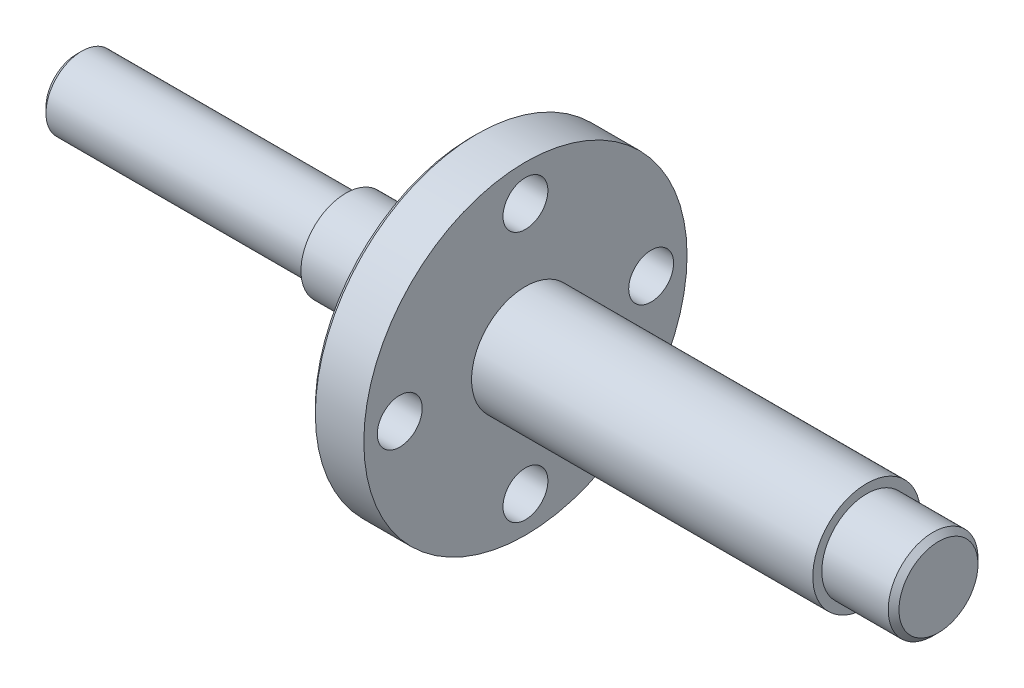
ISO-10303-21;
HEADER;
FILE_DESCRIPTION(('STEP AP214'),'2;1');
FILE_NAME('part.step','',(''),(''),'','','');
FILE_SCHEMA(('AUTOMOTIVE_DESIGN { 1 0 10303 214 1 1 1 1 }'));
ENDSEC;
DATA;
#1=APPLICATION_CONTEXT('core data for automotive mechanical design processes');
#2=APPLICATION_PROTOCOL_DEFINITION('international standard','automotive_design',2000,#1);
#3=PRODUCT_CONTEXT('',#1,'mechanical');
#4=PRODUCT('Part','Part','',(#3));
#5=PRODUCT_RELATED_PRODUCT_CATEGORY('part','',(#4));
#6=PRODUCT_DEFINITION_FORMATION('','',#4);
#7=PRODUCT_DEFINITION_CONTEXT('part definition',#1,'design');
#8=PRODUCT_DEFINITION('design','',#6,#7);
#9=PRODUCT_DEFINITION_SHAPE('','',#8);
#10=(LENGTH_UNIT() NAMED_UNIT(*) SI_UNIT(.MILLI.,.METRE.));
#11=(NAMED_UNIT(*) PLANE_ANGLE_UNIT() SI_UNIT($,.RADIAN.));
#12=(NAMED_UNIT(*) SI_UNIT($,.STERADIAN.) SOLID_ANGLE_UNIT());
#13=UNCERTAINTY_MEASURE_WITH_UNIT(LENGTH_MEASURE(1.E-05),#10,'distance_accuracy_value','');
#14=(GEOMETRIC_REPRESENTATION_CONTEXT(3) GLOBAL_UNCERTAINTY_ASSIGNED_CONTEXT((#13)) GLOBAL_UNIT_ASSIGNED_CONTEXT((#10,
#11,#12)) REPRESENTATION_CONTEXT('',''));
#15=CARTESIAN_POINT('',(0.,0.,0.));
#16=DIRECTION('',(0.,0.,1.));
#17=DIRECTION('',(1.,0.,0.));
#18=AXIS2_PLACEMENT_3D('',#15,#16,#17);
#19=CARTESIAN_POINT('',(44.,0.,0.));
#20=DIRECTION('',(1.,0.,0.));
#21=DIRECTION('',(0.,0.,-1.));
#22=AXIS2_PLACEMENT_3D('',#19,#20,#21);
#23=PLANE('',#22);
#24=CARTESIAN_POINT('',(44.,0.,0.));
#25=DIRECTION('',(1.,0.,0.));
#26=DIRECTION('',(0.,0.,-1.));
#27=AXIS2_PLACEMENT_3D('',#24,#25,#26);
#28=CIRCLE('',#27,3.);
#29=CARTESIAN_POINT('',(44.,0.,-3.));
#30=VERTEX_POINT('',#29);
#31=EDGE_CURVE('E96',#30,#30,#28,.T.);
#32=ORIENTED_EDGE('',*,*,#31,.T.);
#33=EDGE_LOOP('',(#32));
#34=FACE_BOUND('',#33,.T.);
#35=CARTESIAN_POINT('',(44.,0.,0.));
#36=DIRECTION('',(1.,0.,0.));
#37=DIRECTION('',(0.,0.,-1.));
#38=AXIS2_PLACEMENT_3D('',#35,#36,#37);
#39=CIRCLE('',#38,2.5);
#40=CARTESIAN_POINT('',(44.,0.,-2.5));
#41=VERTEX_POINT('',#40);
#42=EDGE_CURVE('E101',#41,#41,#39,.T.);
#43=ORIENTED_EDGE('',*,*,#42,.F.);
#44=EDGE_LOOP('',(#43));
#45=FACE_BOUND('',#44,.T.);
#46=ADVANCED_FACE('F38',(#34,#45),#23,.T.);
#47=CARTESIAN_POINT('',(25.,0.,0.));
#48=DIRECTION('',(1.,0.,0.));
#49=DIRECTION('',(0.,0.,-1.));
#50=AXIS2_PLACEMENT_3D('',#47,#48,#49);
#51=PLANE('',#50);
#52=CARTESIAN_POINT('',(25.,0.,-7.));
#53=DIRECTION('',(1.,0.,0.));
#54=DIRECTION('',(0.,0.,-1.));
#55=AXIS2_PLACEMENT_3D('',#52,#53,#54);
#56=CIRCLE('',#55,1.24999999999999);
#57=CARTESIAN_POINT('',(25.,0.,-8.24999999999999));
#58=VERTEX_POINT('',#57);
#59=EDGE_CURVE('E131',#58,#58,#56,.T.);
#60=ORIENTED_EDGE('',*,*,#59,.F.);
#61=EDGE_LOOP('',(#60));
#62=FACE_BOUND('',#61,.T.);
#63=CARTESIAN_POINT('',(25.,-7.,0.));
#64=DIRECTION('',(1.,0.,0.));
#65=DIRECTION('',(0.,0.,-1.));
#66=AXIS2_PLACEMENT_3D('',#63,#64,#65);
#67=CIRCLE('',#66,1.24999999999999);
#68=CARTESIAN_POINT('',(25.,-7.,-1.24999999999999));
#69=VERTEX_POINT('',#68);
#70=EDGE_CURVE('E123',#69,#69,#67,.T.);
#71=ORIENTED_EDGE('',*,*,#70,.F.);
#72=EDGE_LOOP('',(#71));
#73=FACE_BOUND('',#72,.T.);
#74=CARTESIAN_POINT('',(25.,0.,7.));
#75=DIRECTION('',(1.,0.,0.));
#76=DIRECTION('',(0.,0.,-1.));
#77=AXIS2_PLACEMENT_3D('',#74,#75,#76);
#78=CIRCLE('',#77,1.24999999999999);
#79=CARTESIAN_POINT('',(25.,0.,5.75000000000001));
#80=VERTEX_POINT('',#79);
#81=EDGE_CURVE('E115',#80,#80,#78,.T.);
#82=ORIENTED_EDGE('',*,*,#81,.F.);
#83=EDGE_LOOP('',(#82));
#84=FACE_BOUND('',#83,.T.);
#85=CARTESIAN_POINT('',(25.,7.,0.));
#86=DIRECTION('',(1.,0.,0.));
#87=DIRECTION('',(0.,0.,-1.));
#88=AXIS2_PLACEMENT_3D('',#85,#86,#87);
#89=CIRCLE('',#88,1.24999999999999);
#90=CARTESIAN_POINT('',(25.,7.,-1.24999999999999));
#91=VERTEX_POINT('',#90);
#92=EDGE_CURVE('E108',#91,#91,#89,.T.);
#93=ORIENTED_EDGE('',*,*,#92,.F.);
#94=EDGE_LOOP('',(#93));
#95=FACE_BOUND('',#94,.T.);
#96=CARTESIAN_POINT('',(25.,0.,0.));
#97=DIRECTION('',(1.,0.,0.));
#98=DIRECTION('',(0.,0.,-1.));
#99=AXIS2_PLACEMENT_3D('',#96,#97,#98);
#100=CIRCLE('',#99,9.);
#101=CARTESIAN_POINT('',(25.,0.,-9.));
#102=VERTEX_POINT('',#101);
#103=EDGE_CURVE('E89',#102,#102,#100,.T.);
#104=ORIENTED_EDGE('',*,*,#103,.T.);
#105=EDGE_LOOP('',(#104));
#106=FACE_BOUND('',#105,.T.);
#107=CARTESIAN_POINT('',(25.,0.,0.));
#108=DIRECTION('',(1.,0.,0.));
#109=DIRECTION('',(0.,0.,-1.));
#110=AXIS2_PLACEMENT_3D('',#107,#108,#109);
#111=CIRCLE('',#110,3.);
#112=CARTESIAN_POINT('',(25.,0.,-3.));
#113=VERTEX_POINT('',#112);
#114=EDGE_CURVE('E97',#113,#113,#111,.T.);
#115=ORIENTED_EDGE('',*,*,#114,.F.);
#116=EDGE_LOOP('',(#115));
#117=FACE_BOUND('',#116,.T.);
#118=ADVANCED_FACE('F183',(#62,#73,#84,#95,#106,#117),#51,.T.);
#119=CARTESIAN_POINT('',(15.,0.,0.));
#120=DIRECTION('',(-1.,0.,0.));
#121=DIRECTION('',(0.,0.,1.));
#122=AXIS2_PLACEMENT_3D('',#119,#120,#121);
#123=CYLINDRICAL_SURFACE('',#122,2.);
#124=CARTESIAN_POINT('',(0.300000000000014,0.,0.));
#125=DIRECTION('',(1.,0.,0.));
#126=DIRECTION('',(0.,0.,-1.));
#127=AXIS2_PLACEMENT_3D('',#124,#125,#126);
#128=CIRCLE('',#127,2.);
#129=CARTESIAN_POINT('',(0.300000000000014,0.,-2.));
#130=VERTEX_POINT('',#129);
#131=EDGE_CURVE('E60',#130,#130,#128,.T.);
#132=ORIENTED_EDGE('',*,*,#131,.T.);
#133=EDGE_LOOP('',(#132));
#134=FACE_BOUND('',#133,.T.);
#135=CARTESIAN_POINT('',(15.,0.,0.));
#136=DIRECTION('',(1.,0.,0.));
#137=DIRECTION('',(0.,0.,-1.));
#138=AXIS2_PLACEMENT_3D('',#135,#136,#137);
#139=CIRCLE('',#138,2.);
#140=CARTESIAN_POINT('',(15.,0.,-2.));
#141=VERTEX_POINT('',#140);
#142=EDGE_CURVE('E73',#141,#141,#139,.T.);
#143=ORIENTED_EDGE('',*,*,#142,.F.);
#144=EDGE_LOOP('',(#143));
#145=FACE_BOUND('',#144,.T.);
#146=ADVANCED_FACE('F181',(#134,#145),#123,.T.);
#147=CARTESIAN_POINT('',(0.,0.,0.));
#148=DIRECTION('',(1.,0.,0.));
#149=DIRECTION('',(0.,0.,-1.));
#150=AXIS2_PLACEMENT_3D('',#147,#148,#149);
#151=PLANE('',#150);
#152=CARTESIAN_POINT('',(0.,0.,0.));
#153=DIRECTION('',(1.,0.,0.));
#154=DIRECTION('',(0.,0.,-1.));
#155=AXIS2_PLACEMENT_3D('',#152,#153,#154);
#156=CIRCLE('',#155,1.69999999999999);
#157=CARTESIAN_POINT('',(0.,0.,-1.69999999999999));
#158=VERTEX_POINT('',#157);
#159=EDGE_CURVE('E53',#158,#158,#156,.F.);
#160=ORIENTED_EDGE('',*,*,#159,.T.);
#161=EDGE_LOOP('',(#160));
#162=FACE_BOUND('',#161,.T.);
#163=ADVANCED_FACE('F177',(#162),#151,.F.);
#164=CARTESIAN_POINT('',(15.,0.,0.));
#165=DIRECTION('',(1.,0.,0.));
#166=DIRECTION('',(0.,0.,-1.));
#167=AXIS2_PLACEMENT_3D('',#164,#165,#166);
#168=PLANE('',#167);
#169=CARTESIAN_POINT('',(15.,0.,0.));
#170=DIRECTION('',(1.,0.,0.));
#171=DIRECTION('',(0.,0.,-1.));
#172=AXIS2_PLACEMENT_3D('',#169,#170,#171);
#173=CIRCLE('',#172,2.5);
#174=CARTESIAN_POINT('',(15.,0.,-2.5));
#175=VERTEX_POINT('',#174);
#176=EDGE_CURVE('E77',#175,#175,#173,.T.);
#177=ORIENTED_EDGE('',*,*,#176,.F.);
#178=EDGE_LOOP('',(#177));
#179=FACE_BOUND('',#178,.T.);
#180=ORIENTED_EDGE('',*,*,#142,.T.);
#181=EDGE_LOOP('',(#180));
#182=FACE_BOUND('',#181,.T.);
#183=ADVANCED_FACE('F171',(#179,#182),#168,.F.);
#184=CARTESIAN_POINT('',(19.,0.,0.));
#185=DIRECTION('',(-1.,0.,0.));
#186=DIRECTION('',(0.,0.,1.));
#187=AXIS2_PLACEMENT_3D('',#184,#185,#186);
#188=CYLINDRICAL_SURFACE('',#187,2.5);
#189=CARTESIAN_POINT('',(19.,0.,0.));
#190=DIRECTION('',(1.,0.,0.));
#191=DIRECTION('',(0.,0.,-1.));
#192=AXIS2_PLACEMENT_3D('',#189,#190,#191);
#193=CIRCLE('',#192,2.5);
#194=CARTESIAN_POINT('',(19.,0.,-2.5));
#195=VERTEX_POINT('',#194);
#196=EDGE_CURVE('E76',#195,#195,#193,.T.);
#197=ORIENTED_EDGE('',*,*,#196,.F.);
#198=EDGE_LOOP('',(#197));
#199=FACE_BOUND('',#198,.T.);
#200=ORIENTED_EDGE('',*,*,#176,.T.);
#201=EDGE_LOOP('',(#200));
#202=FACE_BOUND('',#201,.T.);
#203=ADVANCED_FACE('F165',(#199,#202),#188,.T.);
#204=CARTESIAN_POINT('',(19.,0.,0.));
#205=DIRECTION('',(1.,0.,0.));
#206=DIRECTION('',(0.,0.,-1.));
#207=AXIS2_PLACEMENT_3D('',#204,#205,#206);
#208=PLANE('',#207);
#209=CARTESIAN_POINT('',(19.,0.,0.));
#210=DIRECTION('',(1.,0.,0.));
#211=DIRECTION('',(0.,0.,-1.));
#212=AXIS2_PLACEMENT_3D('',#209,#210,#211);
#213=CIRCLE('',#212,3.);
#214=CARTESIAN_POINT('',(19.,0.,-3.));
#215=VERTEX_POINT('',#214);
#216=EDGE_CURVE('E85',#215,#215,#213,.T.);
#217=ORIENTED_EDGE('',*,*,#216,.F.);
#218=EDGE_LOOP('',(#217));
#219=FACE_BOUND('',#218,.T.);
#220=ORIENTED_EDGE('',*,*,#196,.T.);
#221=EDGE_LOOP('',(#220));
#222=FACE_BOUND('',#221,.T.);
#223=ADVANCED_FACE('F159',(#219,#222),#208,.F.);
#224=CARTESIAN_POINT('',(22.,0.,0.));
#225=DIRECTION('',(-1.,0.,0.));
#226=DIRECTION('',(0.,0.,1.));
#227=AXIS2_PLACEMENT_3D('',#224,#225,#226);
#228=CYLINDRICAL_SURFACE('',#227,3.);
#229=CARTESIAN_POINT('',(22.,0.,0.));
#230=DIRECTION('',(1.,0.,0.));
#231=DIRECTION('',(0.,0.,-1.));
#232=AXIS2_PLACEMENT_3D('',#229,#230,#231);
#233=CIRCLE('',#232,3.);
#234=CARTESIAN_POINT('',(22.,0.,-3.));
#235=VERTEX_POINT('',#234);
#236=EDGE_CURVE('E81',#235,#235,#233,.T.);
#237=ORIENTED_EDGE('',*,*,#236,.F.);
#238=EDGE_LOOP('',(#237));
#239=FACE_BOUND('',#238,.T.);
#240=ORIENTED_EDGE('',*,*,#216,.T.);
#241=EDGE_LOOP('',(#240));
#242=FACE_BOUND('',#241,.T.);
#243=ADVANCED_FACE('F146',(#239,#242),#228,.T.);
#244=CARTESIAN_POINT('',(22.,0.,0.));
#245=DIRECTION('',(1.,0.,0.));
#246=DIRECTION('',(0.,0.,-1.));
#247=AXIS2_PLACEMENT_3D('',#244,#245,#246);
#248=PLANE('',#247);
#249=CARTESIAN_POINT('',(22.,0.,0.));
#250=DIRECTION('',(1.,0.,0.));
#251=DIRECTION('',(0.,0.,-1.));
#252=AXIS2_PLACEMENT_3D('',#249,#250,#251);
#253=CIRCLE('',#252,8.70000000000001);
#254=CARTESIAN_POINT('',(22.,0.,-8.70000000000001));
#255=VERTEX_POINT('',#254);
#256=EDGE_CURVE('E65',#255,#255,#253,.F.);
#257=ORIENTED_EDGE('',*,*,#256,.T.);
#258=EDGE_LOOP('',(#257));
#259=FACE_BOUND('',#258,.T.);
#260=CARTESIAN_POINT('',(22.,0.,-7.));
#261=DIRECTION('',(-1.,0.,0.));
#262=DIRECTION('',(0.,0.,1.));
#263=AXIS2_PLACEMENT_3D('',#260,#261,#262);
#264=CIRCLE('',#263,1.24999999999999);
#265=CARTESIAN_POINT('',(22.,0.,-5.75000000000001));
#266=VERTEX_POINT('',#265);
#267=EDGE_CURVE('E135',#266,#266,#264,.T.);
#268=ORIENTED_EDGE('',*,*,#267,.F.);
#269=EDGE_LOOP('',(#268));
#270=FACE_BOUND('',#269,.T.);
#271=CARTESIAN_POINT('',(22.,-7.,0.));
#272=DIRECTION('',(-1.,0.,0.));
#273=DIRECTION('',(0.,0.,1.));
#274=AXIS2_PLACEMENT_3D('',#271,#272,#273);
#275=CIRCLE('',#274,1.24999999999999);
#276=CARTESIAN_POINT('',(22.,-7.,1.24999999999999));
#277=VERTEX_POINT('',#276);
#278=EDGE_CURVE('E127',#277,#277,#275,.T.);
#279=ORIENTED_EDGE('',*,*,#278,.F.);
#280=EDGE_LOOP('',(#279));
#281=FACE_BOUND('',#280,.T.);
#282=CARTESIAN_POINT('',(22.,0.,7.));
#283=DIRECTION('',(-1.,0.,0.));
#284=DIRECTION('',(0.,0.,1.));
#285=AXIS2_PLACEMENT_3D('',#282,#283,#284);
#286=CIRCLE('',#285,1.24999999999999);
#287=CARTESIAN_POINT('',(22.,0.,8.24999999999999));
#288=VERTEX_POINT('',#287);
#289=EDGE_CURVE('E119',#288,#288,#286,.T.);
#290=ORIENTED_EDGE('',*,*,#289,.F.);
#291=EDGE_LOOP('',(#290));
#292=FACE_BOUND('',#291,.T.);
#293=CARTESIAN_POINT('',(22.,7.,0.));
#294=DIRECTION('',(-1.,0.,0.));
#295=DIRECTION('',(0.,0.,1.));
#296=AXIS2_PLACEMENT_3D('',#293,#294,#295);
#297=CIRCLE('',#296,1.24999999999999);
#298=CARTESIAN_POINT('',(22.,7.,1.24999999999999));
#299=VERTEX_POINT('',#298);
#300=EDGE_CURVE('E112',#299,#299,#297,.T.);
#301=ORIENTED_EDGE('',*,*,#300,.F.);
#302=EDGE_LOOP('',(#301));
#303=FACE_BOUND('',#302,.T.);
#304=ORIENTED_EDGE('',*,*,#236,.T.);
#305=EDGE_LOOP('',(#304));
#306=FACE_BOUND('',#305,.T.);
#307=ADVANCED_FACE('F142',(#259,#270,#281,#292,#303,#306),#248,.F.);
#308=CARTESIAN_POINT('',(25.,0.,0.));
#309=DIRECTION('',(-1.,0.,0.));
#310=DIRECTION('',(0.,0.,1.));
#311=AXIS2_PLACEMENT_3D('',#308,#309,#310);
#312=CYLINDRICAL_SURFACE('',#311,9.);
#313=CARTESIAN_POINT('',(22.3,0.,0.));
#314=DIRECTION('',(1.,0.,0.));
#315=DIRECTION('',(0.,0.,-1.));
#316=AXIS2_PLACEMENT_3D('',#313,#314,#315);
#317=CIRCLE('',#316,9.);
#318=CARTESIAN_POINT('',(22.3,0.,-9.));
#319=VERTEX_POINT('',#318);
#320=EDGE_CURVE('E69',#319,#319,#317,.T.);
#321=ORIENTED_EDGE('',*,*,#320,.T.);
#322=EDGE_LOOP('',(#321));
#323=FACE_BOUND('',#322,.T.);
#324=ORIENTED_EDGE('',*,*,#103,.F.);
#325=EDGE_LOOP('',(#324));
#326=FACE_BOUND('',#325,.T.);
#327=ADVANCED_FACE('F145',(#323,#326),#312,.T.);
#328=CARTESIAN_POINT('',(44.,0.,0.));
#329=DIRECTION('',(-1.,0.,0.));
#330=DIRECTION('',(0.,0.,1.));
#331=AXIS2_PLACEMENT_3D('',#328,#329,#330);
#332=CYLINDRICAL_SURFACE('',#331,3.);
#333=ORIENTED_EDGE('',*,*,#31,.F.);
#334=EDGE_LOOP('',(#333));
#335=FACE_BOUND('',#334,.T.);
#336=ORIENTED_EDGE('',*,*,#114,.T.);
#337=EDGE_LOOP('',(#336));
#338=FACE_BOUND('',#337,.T.);
#339=ADVANCED_FACE('F205',(#335,#338),#332,.T.);
#340=CARTESIAN_POINT('',(48.,0.,0.));
#341=DIRECTION('',(-1.,0.,0.));
#342=DIRECTION('',(0.,0.,1.));
#343=AXIS2_PLACEMENT_3D('',#340,#341,#342);
#344=CYLINDRICAL_SURFACE('',#343,2.5);
#345=CARTESIAN_POINT('',(47.7,0.,0.));
#346=DIRECTION('',(1.,0.,0.));
#347=DIRECTION('',(0.,0.,-1.));
#348=AXIS2_PLACEMENT_3D('',#345,#346,#347);
#349=CIRCLE('',#348,2.5);
#350=CARTESIAN_POINT('',(47.7,0.,-2.5));
#351=VERTEX_POINT('',#350);
#352=EDGE_CURVE('E10',#351,#351,#349,.F.);
#353=ORIENTED_EDGE('',*,*,#352,.T.);
#354=EDGE_LOOP('',(#353));
#355=FACE_BOUND('',#354,.T.);
#356=ORIENTED_EDGE('',*,*,#42,.T.);
#357=EDGE_LOOP('',(#356));
#358=FACE_BOUND('',#357,.T.);
#359=ADVANCED_FACE('F203',(#355,#358),#344,.T.);
#360=CARTESIAN_POINT('',(48.,0.,0.));
#361=DIRECTION('',(1.,0.,0.));
#362=DIRECTION('',(0.,0.,-1.));
#363=AXIS2_PLACEMENT_3D('',#360,#361,#362);
#364=PLANE('',#363);
#365=CARTESIAN_POINT('',(48.,0.,0.));
#366=DIRECTION('',(1.,0.,0.));
#367=DIRECTION('',(0.,0.,-1.));
#368=AXIS2_PLACEMENT_3D('',#365,#366,#367);
#369=CIRCLE('',#368,2.20000000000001);
#370=CARTESIAN_POINT('',(48.,0.,-2.20000000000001));
#371=VERTEX_POINT('',#370);
#372=EDGE_CURVE('E46',#371,#371,#369,.T.);
#373=ORIENTED_EDGE('',*,*,#372,.T.);
#374=EDGE_LOOP('',(#373));
#375=FACE_BOUND('',#374,.T.);
#376=ADVANCED_FACE('F245',(#375),#364,.T.);
#377=CARTESIAN_POINT('',(22.,7.,0.));
#378=DIRECTION('',(-1.,0.,0.));
#379=DIRECTION('',(0.,0.,1.));
#380=AXIS2_PLACEMENT_3D('',#377,#378,#379);
#381=CYLINDRICAL_SURFACE('',#380,1.24999999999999);
#382=ORIENTED_EDGE('',*,*,#300,.T.);
#383=EDGE_LOOP('',(#382));
#384=FACE_BOUND('',#383,.T.);
#385=ORIENTED_EDGE('',*,*,#92,.T.);
#386=EDGE_LOOP('',(#385));
#387=FACE_BOUND('',#386,.T.);
#388=ADVANCED_FACE('F242',(#384,#387),#381,.F.);
#389=CARTESIAN_POINT('',(22.,0.,7.));
#390=DIRECTION('',(-1.,0.,0.));
#391=DIRECTION('',(0.,0.,1.));
#392=AXIS2_PLACEMENT_3D('',#389,#390,#391);
#393=CYLINDRICAL_SURFACE('',#392,1.24999999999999);
#394=ORIENTED_EDGE('',*,*,#289,.T.);
#395=EDGE_LOOP('',(#394));
#396=FACE_BOUND('',#395,.T.);
#397=ORIENTED_EDGE('',*,*,#81,.T.);
#398=EDGE_LOOP('',(#397));
#399=FACE_BOUND('',#398,.T.);
#400=ADVANCED_FACE('F236',(#396,#399),#393,.F.);
#401=CARTESIAN_POINT('',(22.,-7.,0.));
#402=DIRECTION('',(-1.,0.,0.));
#403=DIRECTION('',(0.,0.,1.));
#404=AXIS2_PLACEMENT_3D('',#401,#402,#403);
#405=CYLINDRICAL_SURFACE('',#404,1.24999999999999);
#406=ORIENTED_EDGE('',*,*,#278,.T.);
#407=EDGE_LOOP('',(#406));
#408=FACE_BOUND('',#407,.T.);
#409=ORIENTED_EDGE('',*,*,#70,.T.);
#410=EDGE_LOOP('',(#409));
#411=FACE_BOUND('',#410,.T.);
#412=ADVANCED_FACE('F230',(#408,#411),#405,.F.);
#413=CARTESIAN_POINT('',(22.,0.,-7.));
#414=DIRECTION('',(-1.,0.,0.));
#415=DIRECTION('',(0.,0.,1.));
#416=AXIS2_PLACEMENT_3D('',#413,#414,#415);
#417=CYLINDRICAL_SURFACE('',#416,1.24999999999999);
#418=ORIENTED_EDGE('',*,*,#267,.T.);
#419=EDGE_LOOP('',(#418));
#420=FACE_BOUND('',#419,.T.);
#421=ORIENTED_EDGE('',*,*,#59,.T.);
#422=EDGE_LOOP('',(#421));
#423=FACE_BOUND('',#422,.T.);
#424=ADVANCED_FACE('F139',(#420,#423),#417,.F.);
#425=CARTESIAN_POINT('',(22.3,0.,0.));
#426=DIRECTION('',(1.,0.,0.));
#427=DIRECTION('',(0.,0.,-1.));
#428=AXIS2_PLACEMENT_3D('',#425,#426,#427);
#429=CONICAL_SURFACE('',#428,9.,0.78539816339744);
#430=ORIENTED_EDGE('',*,*,#256,.F.);
#431=EDGE_LOOP('',(#430));
#432=FACE_BOUND('',#431,.T.);
#433=ORIENTED_EDGE('',*,*,#320,.F.);
#434=EDGE_LOOP('',(#433));
#435=FACE_BOUND('',#434,.T.);
#436=ADVANCED_FACE('F221',(#432,#435),#429,.T.);
#437=CARTESIAN_POINT('',(0.300000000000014,0.,0.));
#438=DIRECTION('',(1.,0.,0.));
#439=DIRECTION('',(0.,0.,-1.));
#440=AXIS2_PLACEMENT_3D('',#437,#438,#439);
#441=CONICAL_SURFACE('',#440,2.,0.785398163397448);
#442=ORIENTED_EDGE('',*,*,#159,.F.);
#443=EDGE_LOOP('',(#442));
#444=FACE_BOUND('',#443,.T.);
#445=ORIENTED_EDGE('',*,*,#131,.F.);
#446=EDGE_LOOP('',(#445));
#447=FACE_BOUND('',#446,.T.);
#448=ADVANCED_FACE('F223',(#444,#447),#441,.T.);
#449=CARTESIAN_POINT('',(48.,0.,0.));
#450=DIRECTION('',(-1.,0.,0.));
#451=DIRECTION('',(0.,0.,1.));
#452=AXIS2_PLACEMENT_3D('',#449,#450,#451);
#453=CONICAL_SURFACE('',#452,2.20000000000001,0.785398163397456);
#454=ORIENTED_EDGE('',*,*,#352,.F.);
#455=EDGE_LOOP('',(#454));
#456=FACE_BOUND('',#455,.T.);
#457=ORIENTED_EDGE('',*,*,#372,.F.);
#458=EDGE_LOOP('',(#457));
#459=FACE_BOUND('',#458,.T.);
#460=ADVANCED_FACE('F40',(#456,#459),#453,.T.);
#461=CLOSED_SHELL('',(#46,#118,#146,#163,#183,#203,#223,#243,#307,#327,#339,#359,#376,#388,#400,
#412,#424,#436,#448,#460));
#462=MANIFOLD_SOLID_BREP('B2',#461);
#463=ADVANCED_BREP_SHAPE_REPRESENTATION('',(#18,#462),#14);
#464=SHAPE_DEFINITION_REPRESENTATION(#9,#463);
ENDSEC;
END-ISO-10303-21;
